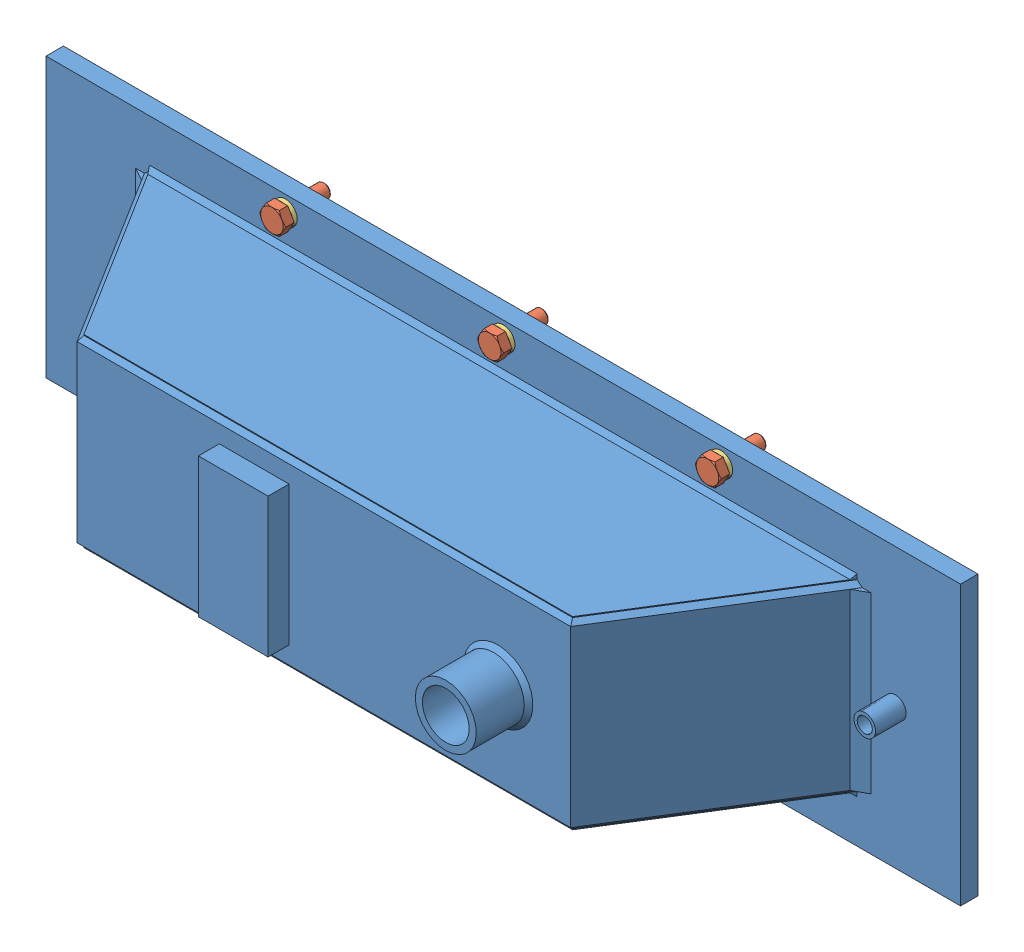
SolidWorks assembly 167 Carter de roue avec vis.SLDASM, configuration Default (file format 3100). Lengths in mm.
Overall size (525 160 155.5).
13 component instances, 3 part files, 6 mates.
Components (placement in the parent):
- 167 - Carter de roue-1: 167 - Carter de roue.SLDPRT [Default<Brut d'usinage>] at origin size (525 160 155.5)
- VisHM8x25-1: VisHM8x25.SLDPRT [Défaut] at (87.6301 -36.5972 12.5) x (0 1 0) z (0 0 -1) size (13 15.01 30.3)
- Rondelle W8-1: Rondelle W8.SLDPRT [Défaut] at (87.6301 -36.5972 10) x (0 0 1) z (0.439492 0.898247 0) size (2.5 13.4 13.4)
- Rondelle W8-2: Rondelle W8.SLDPRT [Défaut] at (87.6301 105.4028 10) x (0 0 1) z (0.439492 0.898247 0) size (2.5 13.4 13.4)
- Rondelle W8-3: Rondelle W8.SLDPRT [Défaut] at (212.6301 -36.5972 10) x (0 0 1) z (0.439492 0.898247 0) size (2.5 13.4 13.4)
- Rondelle W8-4: Rondelle W8.SLDPRT [Défaut] at (212.6301 105.4028 10) x (0 0 1) z (0.439492 0.898247 0) size (2.5 13.4 13.4)
- Rondelle W8-5: Rondelle W8.SLDPRT [Défaut] at (337.6301 -36.5972 10) x (0 0 1) z (0.439492 0.898247 0) size (2.5 13.4 13.4)
- Rondelle W8-6: Rondelle W8.SLDPRT [Défaut] at (337.6301 105.4028 10) x (0 0 1) z (0.439492 0.898247 0) size (2.5 13.4 13.4)
- VisHM8x25-2: VisHM8x25.SLDPRT [Défaut] at (87.6301 105.4028 12.5) x (0 1 0) z (0 0 -1) size (13 15.01 30.3)
- VisHM8x25-3: VisHM8x25.SLDPRT [Défaut] at (212.6301 -36.5972 12.5) x (0 1 0) z (0 0 -1) size (13 15.01 30.3)
- VisHM8x25-4: VisHM8x25.SLDPRT [Défaut] at (212.6301 105.4028 12.5) x (0 1 0) z (0 0 -1) size (13 15.01 30.3)
- VisHM8x25-5: VisHM8x25.SLDPRT [Défaut] at (337.6301 -36.5972 12.5) x (0 1 0) z (0 0 -1) size (13 15.01 30.3)
- VisHM8x25-6: VisHM8x25.SLDPRT [Défaut] at (337.6301 105.4028 12.5) x (0 1 0) z (0 0 -1) size (13 15.01 30.3)
Mates (geometry in assembly coordinates):
- Coaxiale1: concentric aligned: cylinder of 167 - Carter de roue-1; cylinder of VisHM8x25-1
- Parallèle1: parallel aligned: plane of 167 - Carter de roue-1 through (-49.8699 -45.5972 10) normal (0 -1 0); plane of VisHM8x25-1 through (83.8774 -43.0972 17.8) normal (0 -1 0)
- Coaxiale2: concentric aligned: cylinder of VisHM8x25-1; cylinder of Rondelle W8-1
- Coïncidente4: coincident anti-aligned: plane of VisHM8x25-1 through (91.3829 -30.0972 12.5) normal (0 0 -1); plane of Rondelle W8-1 through (84.6855 -42.6154 12.5) normal (0 0 1)
- Coïncidente5: coincident anti-aligned: plane of 167 - Carter de roue-1 through (-49.8699 -45.5972 10) normal (0 0 1); plane of Rondelle W8-1 through (84.6855 -42.6154 10) normal (0 0 -1)
- Parallèle3: parallel aligned: plane of 167 - Carter de roue-1 through (-49.8699 114.4028 10) normal (-1 0 0); plane of ? through (-43.8699 38.1556 17.8) normal (-1 0 0)
